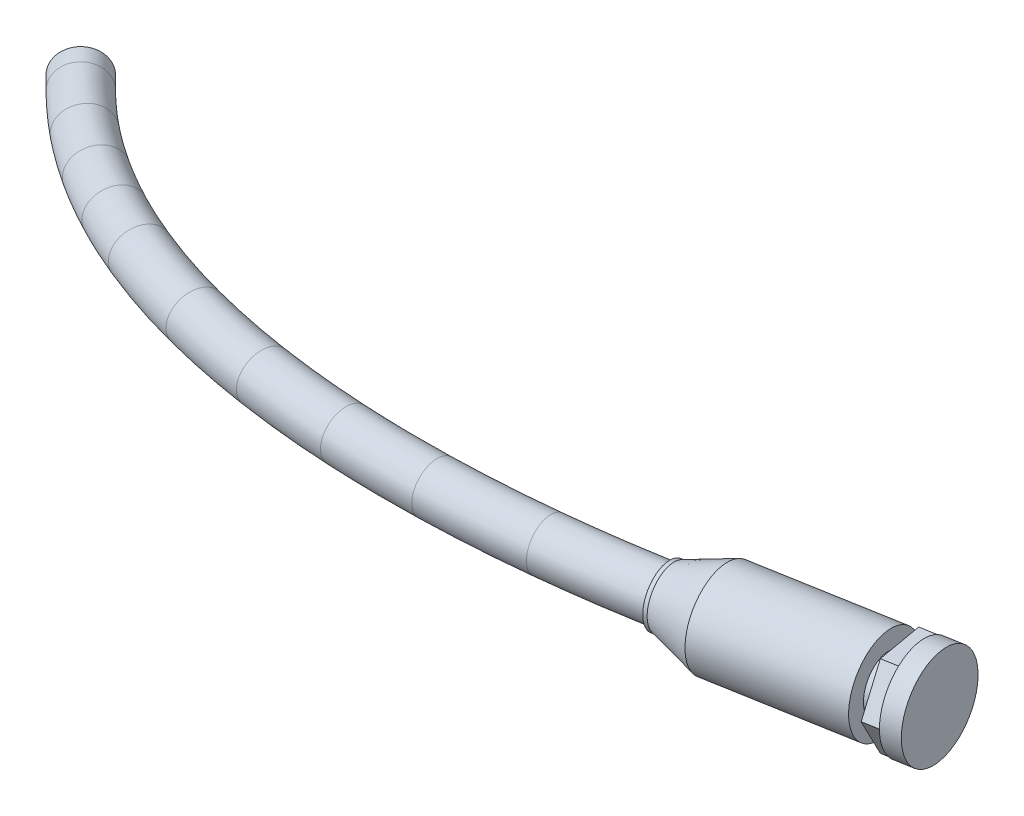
ISO-10303-21;
HEADER;
FILE_DESCRIPTION(('STEP AP214'),'2;1');
FILE_NAME('part.step','',(''),(''),'','','');
FILE_SCHEMA(('AUTOMOTIVE_DESIGN { 1 0 10303 214 1 1 1 1 }'));
ENDSEC;
DATA;
#1=APPLICATION_CONTEXT('core data for automotive mechanical design processes');
#2=APPLICATION_PROTOCOL_DEFINITION('international standard','automotive_design',2000,#1);
#3=PRODUCT_CONTEXT('',#1,'mechanical');
#4=PRODUCT('Part','Part','',(#3));
#5=PRODUCT_RELATED_PRODUCT_CATEGORY('part','',(#4));
#6=PRODUCT_DEFINITION_FORMATION('','',#4);
#7=PRODUCT_DEFINITION_CONTEXT('part definition',#1,'design');
#8=PRODUCT_DEFINITION('design','',#6,#7);
#9=PRODUCT_DEFINITION_SHAPE('','',#8);
#10=(LENGTH_UNIT() NAMED_UNIT(*) SI_UNIT(.MILLI.,.METRE.));
#11=(NAMED_UNIT(*) PLANE_ANGLE_UNIT() SI_UNIT($,.RADIAN.));
#12=(NAMED_UNIT(*) SI_UNIT($,.STERADIAN.) SOLID_ANGLE_UNIT());
#13=UNCERTAINTY_MEASURE_WITH_UNIT(LENGTH_MEASURE(1.E-05),#10,'distance_accuracy_value','');
#14=(GEOMETRIC_REPRESENTATION_CONTEXT(3) GLOBAL_UNCERTAINTY_ASSIGNED_CONTEXT((#13)) GLOBAL_UNIT_ASSIGNED_CONTEXT((#10,
#11,#12)) REPRESENTATION_CONTEXT('',''));
#15=CARTESIAN_POINT('',(0.,0.,0.));
#16=DIRECTION('',(0.,0.,1.));
#17=DIRECTION('',(1.,0.,0.));
#18=AXIS2_PLACEMENT_3D('',#15,#16,#17);
#19=CARTESIAN_POINT('',(-363.716003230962,-33.602255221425,116.094854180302));
#20=DIRECTION('',(-0.984807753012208,0.,0.173648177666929));
#21=DIRECTION('',(0.158351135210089,0.410395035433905,0.898053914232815));
#22=AXIS2_PLACEMENT_3D('',#19,#20,#21);
#23=CYLINDRICAL_SURFACE('',#22,7.1);
#24=CARTESIAN_POINT('',(-382.575071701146,-33.602255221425,119.420216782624));
#25=DIRECTION('',(-0.984807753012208,0.,0.173648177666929));
#26=DIRECTION('',(-0.158351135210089,-0.410395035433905,-0.898053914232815));
#27=AXIS2_PLACEMENT_3D('',#24,#25,#26);
#28=CIRCLE('',#27,7.1);
#29=CARTESIAN_POINT('',(-381.450778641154,-30.6884504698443,125.796399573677));
#30=VERTEX_POINT('',#29);
#31=EDGE_CURVE('E202',#30,#30,#28,.T.);
#32=CARTESIAN_POINT('',(-360.515378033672,-33.602255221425,115.530497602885));
#33=DIRECTION('',(0.984807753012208,0.,-0.173648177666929));
#34=DIRECTION('',(-0.173648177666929,0.,-0.984807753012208));
#35=AXIS2_PLACEMENT_3D('',#32,#33,#34);
#36=CIRCLE('',#35,7.1);
#37=CARTESIAN_POINT('',(-359.39108497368,-30.6884504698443,121.906680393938));
#38=VERTEX_POINT('',#37);
#39=EDGE_CURVE('E21',#38,#38,#36,.F.);
#40=CARTESIAN_POINT('',(-381.450778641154,-30.6884504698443,125.796399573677));
#41=CARTESIAN_POINT('',(-381.220990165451,-30.6884504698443,125.755881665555));
#42=CARTESIAN_POINT('',(-380.991201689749,-30.6884504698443,125.715363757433));
#43=CARTESIAN_POINT('',(-380.531624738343,-30.6884504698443,125.634327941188));
#44=CARTESIAN_POINT('',(-380.30183626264,-30.6884504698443,125.593810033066));
#45=CARTESIAN_POINT('',(-379.842259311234,-30.6884504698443,125.512774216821));
#46=CARTESIAN_POINT('',(-379.612470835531,-30.6884504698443,125.472256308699));
#47=CARTESIAN_POINT('',(-379.152893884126,-30.6884504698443,125.391220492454));
#48=CARTESIAN_POINT('',(-378.923105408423,-30.6884504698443,125.350702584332));
#49=CARTESIAN_POINT('',(-378.463528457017,-30.6884504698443,125.269666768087));
#50=CARTESIAN_POINT('',(-378.233739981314,-30.6884504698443,125.229148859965));
#51=CARTESIAN_POINT('',(-377.774163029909,-30.6884504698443,125.148113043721));
#52=CARTESIAN_POINT('',(-377.544374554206,-30.6884504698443,125.107595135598));
#53=CARTESIAN_POINT('',(-377.0847976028,-30.6884504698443,125.026559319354));
#54=CARTESIAN_POINT('',(-376.855009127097,-30.6884504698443,124.986041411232));
#55=CARTESIAN_POINT('',(-376.395432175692,-30.6884504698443,124.905005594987));
#56=CARTESIAN_POINT('',(-376.165643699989,-30.6884504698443,124.864487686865));
#57=CARTESIAN_POINT('',(-375.706066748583,-30.6884504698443,124.78345187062));
#58=CARTESIAN_POINT('',(-375.47627827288,-30.6884504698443,124.742933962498));
#59=CARTESIAN_POINT('',(-375.016701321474,-30.6884504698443,124.661898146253));
#60=CARTESIAN_POINT('',(-374.786912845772,-30.6884504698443,124.621380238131));
#61=CARTESIAN_POINT('',(-374.327335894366,-30.6884504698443,124.540344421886));
#62=CARTESIAN_POINT('',(-374.097547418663,-30.6884504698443,124.499826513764));
#63=CARTESIAN_POINT('',(-373.637970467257,-30.6884504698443,124.41879069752));
#64=CARTESIAN_POINT('',(-373.408181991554,-30.6884504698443,124.378272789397));
#65=CARTESIAN_POINT('',(-372.948605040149,-30.6884504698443,124.297236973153));
#66=CARTESIAN_POINT('',(-372.718816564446,-30.6884504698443,124.25671906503));
#67=CARTESIAN_POINT('',(-372.25923961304,-30.6884504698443,124.175683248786));
#68=CARTESIAN_POINT('',(-372.029451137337,-30.6884504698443,124.135165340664));
#69=CARTESIAN_POINT('',(-371.569874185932,-30.6884504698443,124.054129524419));
#70=CARTESIAN_POINT('',(-371.340085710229,-30.6884504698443,124.013611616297));
#71=CARTESIAN_POINT('',(-370.880508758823,-30.6884504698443,123.932575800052));
#72=CARTESIAN_POINT('',(-370.65072028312,-30.6884504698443,123.89205789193));
#73=CARTESIAN_POINT('',(-370.191143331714,-30.6884504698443,123.811022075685));
#74=CARTESIAN_POINT('',(-369.961354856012,-30.6884504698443,123.770504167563));
#75=CARTESIAN_POINT('',(-369.501777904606,-30.6884504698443,123.689468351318));
#76=CARTESIAN_POINT('',(-369.271989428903,-30.6884504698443,123.648950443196));
#77=CARTESIAN_POINT('',(-368.812412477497,-30.6884504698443,123.567914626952));
#78=CARTESIAN_POINT('',(-368.582624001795,-30.6884504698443,123.527396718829));
#79=CARTESIAN_POINT('',(-368.123047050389,-30.6884504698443,123.446360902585));
#80=CARTESIAN_POINT('',(-367.893258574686,-30.6884504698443,123.405842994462));
#81=CARTESIAN_POINT('',(-367.43368162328,-30.6884504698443,123.324807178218));
#82=CARTESIAN_POINT('',(-367.203893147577,-30.6884504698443,123.284289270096));
#83=CARTESIAN_POINT('',(-366.744316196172,-30.6884504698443,123.203253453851));
#84=CARTESIAN_POINT('',(-366.514527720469,-30.6884504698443,123.162735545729));
#85=CARTESIAN_POINT('',(-366.054950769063,-30.6884504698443,123.081699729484));
#86=CARTESIAN_POINT('',(-365.82516229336,-30.6884504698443,123.041181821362));
#87=CARTESIAN_POINT('',(-365.365585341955,-30.6884504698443,122.960146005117));
#88=CARTESIAN_POINT('',(-365.135796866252,-30.6884504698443,122.919628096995));
#89=CARTESIAN_POINT('',(-364.676219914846,-30.6884504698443,122.83859228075));
#90=CARTESIAN_POINT('',(-364.446431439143,-30.6884504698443,122.798074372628));
#91=CARTESIAN_POINT('',(-363.986854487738,-30.6884504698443,122.717038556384));
#92=CARTESIAN_POINT('',(-363.757066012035,-30.6884504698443,122.676520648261));
#93=CARTESIAN_POINT('',(-363.297489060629,-30.6884504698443,122.595484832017));
#94=CARTESIAN_POINT('',(-363.067700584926,-30.6884504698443,122.554966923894));
#95=CARTESIAN_POINT('',(-362.60812363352,-30.6884504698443,122.47393110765));
#96=CARTESIAN_POINT('',(-362.378335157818,-30.6884504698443,122.433413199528));
#97=CARTESIAN_POINT('',(-361.918758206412,-30.6884504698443,122.352377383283));
#98=CARTESIAN_POINT('',(-361.688969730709,-30.6884504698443,122.311859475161));
#99=CARTESIAN_POINT('',(-361.229392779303,-30.6884504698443,122.230823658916));
#100=CARTESIAN_POINT('',(-360.9996043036,-30.6884504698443,122.190305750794));
#101=CARTESIAN_POINT('',(-360.540027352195,-30.6884504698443,122.109269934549));
#102=CARTESIAN_POINT('',(-360.310238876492,-30.6884504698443,122.068752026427));
#103=CARTESIAN_POINT('',(-359.850661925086,-30.6884504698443,121.987716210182));
#104=CARTESIAN_POINT('',(-359.620873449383,-30.6884504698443,121.94719830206));
#105=CARTESIAN_POINT('',(-359.39108497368,-30.6884504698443,121.906680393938));
#106=B_SPLINE_CURVE_WITH_KNOTS('',3,(#40,#41,#42,#43,#44,#45,#46,#47,#48,#49,#50,#51,#52,#53,
#54,#55,#56,#57,#58,#59,#60,#61,#62,#63,#64,#65,#66,#67,#68,#69,#70,#71,#72,#73,#74,#75,#76,#77,
#78,#79,#80,#81,#82,#83,#84,#85,#86,#87,#88,#89,#90,#91,#92,#93,#94,#95,#96,#97,#98,#99,#100,
#101,#102,#103,#104,#105),.UNSPECIFIED.,.F.,.F.,(4,2,2,2,2,2,2,2,2,2,2,2,2,2,2,2,2,2,2,2,2,2,2,
2,2,2,2,2,2,2,2,2,4),(0.,0.699999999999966,1.39999999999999,2.10000000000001,2.80000000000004,
3.50000000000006,4.20000000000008,4.90000000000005,5.60000000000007,6.30000000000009,
7.00000000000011,7.70000000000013,8.40000000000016,9.10000000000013,9.80000000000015,
10.5000000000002,11.2000000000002,11.9000000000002,12.6000000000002,13.3000000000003,
14.0000000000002,14.7000000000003,15.4000000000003,16.1000000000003,16.8000000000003,
17.5000000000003,18.2000000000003,18.9000000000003,19.6000000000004,20.3000000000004,
21.0000000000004,21.7000000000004,22.4000000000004),.UNSPECIFIED.);
#107=EDGE_CURVE('BSEAM17',#30,#38,#106,.T.);
#108=ORIENTED_EDGE('',*,*,#31,.F.);
#109=ORIENTED_EDGE('',*,*,#39,.T.);
#110=ORIENTED_EDGE('',*,*,#107,.T.);
#111=ORIENTED_EDGE('',*,*,#107,.F.);
#112=EDGE_LOOP('',(#108,#110,#109,#111));
#113=FACE_BOUND('',#112,.T.);
#114=ADVANCED_FACE('F17',(#113),#23,.T.);
#115=CARTESIAN_POINT('',(-504.622129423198,-30.2644895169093,98.9526170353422));
#116=DIRECTION('',(-0.707106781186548,0.,-0.707106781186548));
#117=DIRECTION('',(0.0192656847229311,0.999628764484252,-0.019265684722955));
#118=AXIS2_PLACEMENT_3D('',#115,#116,#117);
#119=PLANE('',#118);
#120=CARTESIAN_POINT('',(-504.622129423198,-30.2644895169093,98.9526170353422));
#121=DIRECTION('',(-0.707106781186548,0.,-0.707106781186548));
#122=DIRECTION('',(0.0192656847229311,0.999628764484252,-0.019265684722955));
#123=AXIS2_PLACEMENT_3D('',#120,#121,#122);
#124=CIRCLE('',#123,3.9);
#125=CARTESIAN_POINT('',(-504.546993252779,-26.3659373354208,98.8774808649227));
#126=VERTEX_POINT('',#125);
#127=EDGE_CURVE('E272',#126,#126,#124,.T.);
#128=ORIENTED_EDGE('',*,*,#127,.T.);
#129=EDGE_LOOP('',(#128));
#130=FACE_BOUND('',#129,.T.);
#131=ADVANCED_FACE('F345',(#130),#119,.T.);
#132=CARTESIAN_POINT('',(-502.536164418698,-30.2644895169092,101.038582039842));
#133=DIRECTION('',(-0.707106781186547,0.,-0.707106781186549));
#134=DIRECTION('',(-0.707106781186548,0.,0.707106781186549));
#135=AXIS2_PLACEMENT_3D('',#132,#133,#134);
#136=CYLINDRICAL_SURFACE('',#135,3.9);
#137=CARTESIAN_POINT('',(-502.536164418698,-30.2644895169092,101.038582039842));
#138=DIRECTION('',(-0.707106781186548,0.,-0.707106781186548));
#139=DIRECTION('',(0.0192656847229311,0.999628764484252,-0.019265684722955));
#140=AXIS2_PLACEMENT_3D('',#137,#138,#139);
#141=CIRCLE('',#140,3.9);
#142=CARTESIAN_POINT('',(-505.279085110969,-29.8610392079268,103.781502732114));
#143=VERTEX_POINT('',#142);
#144=EDGE_CURVE('E276',#143,#143,#141,.T.);
#145=ORIENTED_EDGE('',*,*,#144,.T.);
#146=EDGE_LOOP('',(#145));
#147=FACE_BOUND('',#146,.T.);
#148=ORIENTED_EDGE('',*,*,#127,.F.);
#149=EDGE_LOOP('',(#148));
#150=FACE_BOUND('',#149,.T.);
#151=ADVANCED_FACE('F880',(#147,#150),#136,.T.);
#152=CARTESIAN_POINT('',(-451.406436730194,-37.7850512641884,49.9088543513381));
#153=DIRECTION('',(-0.073149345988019,-0.994634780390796,0.0731493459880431));
#154=DIRECTION('',(-0.98125293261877,0.0848898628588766,0.173021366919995));
#155=AXIS2_PLACEMENT_3D('',#152,#153,#154);
#156=TOROIDAL_SURFACE('',#155,72.6983972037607,3.9);
#157=CARTESIAN_POINT('',(-496.585840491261,-30.3099152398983,106.371238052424));
#158=DIRECTION('',(-0.780020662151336,0.0113529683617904,-0.625650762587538));
#159=DIRECTION('',(0.0255116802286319,0.999581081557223,-0.0136680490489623));
#160=AXIS2_PLACEMENT_3D('',#157,#158,#159);
#161=CIRCLE('',#160,3.9);
#162=CARTESIAN_POINT('',(-499.009548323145,-29.9089018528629,109.400236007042));
#163=VERTEX_POINT('',#162);
#164=EDGE_CURVE('E280',#163,#163,#161,.T.);
#165=CARTESIAN_POINT('',(-451.406436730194,-37.7850512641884,49.9088543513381));
#166=DIRECTION('',(-0.073149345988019,-0.994634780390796,0.0731493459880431));
#167=DIRECTION('',(-0.98125293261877,0.0848898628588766,0.173021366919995));
#168=AXIS2_PLACEMENT_3D('',#165,#166,#167);
#169=CIRCLE('',#168,76.5983972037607);
#170=EDGE_CURVE('',#163,#143,#169,.T.);
#171=ORIENTED_EDGE('',*,*,#164,.T.);
#172=ORIENTED_EDGE('',*,*,#144,.F.);
#173=ORIENTED_EDGE('',*,*,#170,.T.);
#174=ORIENTED_EDGE('',*,*,#170,.F.);
#175=EDGE_LOOP('',(#171,#173,#172,#174));
#176=FACE_BOUND('',#175,.T.);
#177=ADVANCED_FACE('F867',(#176),#156,.T.);
#178=CARTESIAN_POINT('',(-451.02469776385,-36.973098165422,49.4476606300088));
#179=DIRECTION('',(-0.0657658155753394,-0.995785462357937,0.0639231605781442));
#180=DIRECTION('',(-0.98196192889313,0.0759677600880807,0.173146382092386));
#181=AXIS2_PLACEMENT_3D('',#178,#179,#180);
#182=TOROIDAL_SURFACE('',#181,73.2154997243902,3.9);
#183=CARTESIAN_POINT('',(-490.091022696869,-30.4401783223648,111.024057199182));
#184=DIRECTION('',(-0.843188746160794,0.0212028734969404,-0.537199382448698));
#185=DIRECTION('',(0.0312304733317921,0.99946638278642,-0.00957116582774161));
#186=AXIS2_PLACEMENT_3D('',#183,#184,#185);
#187=CIRCLE('',#186,3.9);
#188=CARTESIAN_POINT('',(-492.17369868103,-30.1188926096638,114.305708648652));
#189=VERTEX_POINT('',#188);
#190=EDGE_CURVE('E284',#189,#189,#187,.T.);
#191=ORIENTED_EDGE('',*,*,#190,.T.);
#192=EDGE_LOOP('',(#191));
#193=FACE_BOUND('',#192,.T.);
#194=ORIENTED_EDGE('',*,*,#164,.F.);
#195=EDGE_LOOP('',(#194));
#196=FACE_BOUND('',#195,.T.);
#197=ADVANCED_FACE('F854',(#193,#196),#182,.T.);
#198=CARTESIAN_POINT('',(-449.838395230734,-36.6497827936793,47.5983998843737));
#199=DIRECTION('',(-0.0620961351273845,-0.996375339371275,0.0581399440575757));
#200=DIRECTION('',(-0.982299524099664,0.0713257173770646,0.173205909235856));
#201=AXIS2_PLACEMENT_3D('',#198,#199,#200);
#202=TOROIDAL_SURFACE('',#201,75.3767020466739,3.9);
#203=CARTESIAN_POINT('',(-483.27639110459,-30.6396148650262,114.884546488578));
#204=DIRECTION('',(-0.894065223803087,0.0296394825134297,-0.446955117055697));
#205=DIRECTION('',(0.0364384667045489,0.999313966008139,-0.00662083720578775));
#206=AXIS2_PLACEMENT_3D('',#203,#204,#205);
#207=CIRCLE('',#206,3.9);
#208=CARTESIAN_POINT('',(-485.006477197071,-30.328648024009,118.365940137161));
#209=VERTEX_POINT('',#208);
#210=EDGE_CURVE('E288',#209,#209,#207,.T.);
#211=CARTESIAN_POINT('',(-449.838395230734,-36.6497827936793,47.5983998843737));
#212=DIRECTION('',(-0.0620961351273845,-0.996375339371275,0.0581399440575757));
#213=DIRECTION('',(-0.982299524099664,0.0713257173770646,0.173205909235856));
#214=AXIS2_PLACEMENT_3D('',#211,#212,#213);
#215=CIRCLE('',#214,79.2767020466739);
#216=EDGE_CURVE('',#209,#189,#215,.T.);
#217=ORIENTED_EDGE('',*,*,#210,.T.);
#218=ORIENTED_EDGE('',*,*,#190,.F.);
#219=ORIENTED_EDGE('',*,*,#216,.T.);
#220=ORIENTED_EDGE('',*,*,#216,.F.);
#221=EDGE_LOOP('',(#217,#219,#218,#220));
#222=FACE_BOUND('',#221,.T.);
#223=ADVANCED_FACE('F841',(#222),#202,.T.);
#224=CARTESIAN_POINT('',(-446.379813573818,-35.9818252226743,40.7243323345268));
#225=DIRECTION('',(-0.0552480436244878,-0.997486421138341,0.0443677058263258));
#226=DIRECTION('',(-0.982903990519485,0.0621492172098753,0.173312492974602));
#227=AXIS2_PLACEMENT_3D('',#224,#225,#226);
#228=TOROIDAL_SURFACE('',#227,83.0038192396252,3.9);
#229=CARTESIAN_POINT('',(-476.113378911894,-30.895436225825,118.05270841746));
#230=DIRECTION('',(-0.932001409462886,0.0355770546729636,-0.360704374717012));
#231=DIRECTION('',(0.0400805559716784,0.999183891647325,-0.00500996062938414));
#232=AXIS2_PLACEMENT_3D('',#229,#230,#231);
#233=CIRCLE('',#232,3.9);
#234=CARTESIAN_POINT('',(-477.513020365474,-30.705137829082,121.687923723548));
#235=VERTEX_POINT('',#234);
#236=EDGE_CURVE('E292',#235,#235,#233,.T.);
#237=ORIENTED_EDGE('',*,*,#236,.T.);
#238=EDGE_LOOP('',(#237));
#239=FACE_BOUND('',#238,.T.);
#240=ORIENTED_EDGE('',*,*,#210,.F.);
#241=EDGE_LOOP('',(#240));
#242=FACE_BOUND('',#241,.T.);
#243=ADVANCED_FACE('F828',(#239,#242),#228,.T.);
#244=CARTESIAN_POINT('',(-443.431482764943,-35.3389402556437,33.1697344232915));
#245=DIRECTION('',(-0.0507619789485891,-0.998175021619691,0.0327085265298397));
#246=DIRECTION('',(-0.983279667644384,0.0556858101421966,0.173378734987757));
#247=AXIS2_PLACEMENT_3D('',#244,#245,#246);
#248=TOROIDAL_SURFACE('',#247,91.0657473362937,3.9);
#249=CARTESIAN_POINT('',(-463.478255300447,-31.4114411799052,121.914717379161));
#250=DIRECTION('',(-0.974147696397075,0.0422680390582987,-0.221922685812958));
#251=DIRECTION('',(0.0442014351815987,0.999015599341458,-0.00375038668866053));
#252=AXIS2_PLACEMENT_3D('',#249,#250,#251);
#253=CIRCLE('',#252,3.9);
#254=CARTESIAN_POINT('',(-464.336782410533,-31.2432413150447,125.715327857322));
#255=VERTEX_POINT('',#254);
#256=EDGE_CURVE('E296',#255,#255,#253,.T.);
#257=CARTESIAN_POINT('',(-443.431482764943,-35.3389402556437,33.1697344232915));
#258=DIRECTION('',(-0.0507619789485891,-0.998175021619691,0.0327085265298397));
#259=DIRECTION('',(-0.983279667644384,0.0556858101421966,0.173378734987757));
#260=AXIS2_PLACEMENT_3D('',#257,#258,#259);
#261=CIRCLE('',#260,94.9657473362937);
#262=EDGE_CURVE('',#255,#235,#261,.T.);
#263=ORIENTED_EDGE('',*,*,#256,.T.);
#264=ORIENTED_EDGE('',*,*,#236,.F.);
#265=ORIENTED_EDGE('',*,*,#262,.T.);
#266=ORIENTED_EDGE('',*,*,#262,.F.);
#267=EDGE_LOOP('',(#263,#265,#264,#266));
#268=FACE_BOUND('',#267,.T.);
#269=ADVANCED_FACE('F815',(#268),#248,.T.);
#270=CARTESIAN_POINT('',(-436.845440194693,-31.8042552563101,4.93299075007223));
#271=DIRECTION('',(-0.0419398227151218,-0.999100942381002,-0.00619340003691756));
#272=DIRECTION('',(-0.984010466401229,0.0402307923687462,0.173507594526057));
#273=AXIS2_PLACEMENT_3D('',#270,#271,#272);
#274=TOROIDAL_SURFACE('',#273,119.975770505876,3.9);
#275=CARTESIAN_POINT('',(-450.440962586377,-31.9724836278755,124.135838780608));
#276=DIRECTION('',(-0.992673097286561,0.042371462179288,-0.113158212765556));
#277=DIRECTION('',(0.0430932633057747,0.999063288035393,-0.0039391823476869));
#278=AXIS2_PLACEMENT_3D('',#275,#276,#277);
#279=CIRCLE('',#278,3.9);
#280=CARTESIAN_POINT('',(-450.887187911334,-32.0838357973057,128.008626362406));
#281=VERTEX_POINT('',#280);
#282=EDGE_CURVE('E300',#281,#281,#279,.T.);
#283=ORIENTED_EDGE('',*,*,#282,.T.);
#284=EDGE_LOOP('',(#283));
#285=FACE_BOUND('',#284,.T.);
#286=ORIENTED_EDGE('',*,*,#256,.F.);
#287=EDGE_LOOP('',(#286));
#288=FACE_BOUND('',#287,.T.);
#289=ADVANCED_FACE('F802',(#285,#288),#274,.T.);
#290=CARTESIAN_POINT('',(-434.36979547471,-27.9620449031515,-15.3457480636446));
#291=DIRECTION('',(-0.038844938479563,-0.998693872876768,-0.0331906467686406));
#292=DIRECTION('',(-0.173512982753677,0.0394525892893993,-0.984041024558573));
#293=AXIS2_PLACEMENT_3D('',#290,#291,#292);
#294=TOROIDAL_SURFACE('',#293,140.46166416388,3.9);
#295=CARTESIAN_POINT('',(-436.577679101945,-32.5412198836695,125.023890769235));
#296=DIRECTION('',(-0.999121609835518,0.0393412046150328,-0.0144318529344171));
#297=DIRECTION('',(0.0394051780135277,0.999214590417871,-0.00417543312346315));
#298=AXIS2_PLACEMENT_3D('',#295,#296,#297);
#299=CIRCLE('',#298,3.9);
#300=CARTESIAN_POINT('',(-436.638982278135,-32.6683633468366,128.921335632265));
#301=VERTEX_POINT('',#300);
#302=EDGE_CURVE('E304',#301,#301,#299,.T.);
#303=CARTESIAN_POINT('',(-434.36979547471,-27.9620449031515,-15.3457480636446));
#304=DIRECTION('',(-0.038844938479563,-0.998693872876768,-0.0331906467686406));
#305=DIRECTION('',(-0.173512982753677,0.0394525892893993,-0.984041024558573));
#306=AXIS2_PLACEMENT_3D('',#303,#304,#305);
#307=CIRCLE('',#306,144.36166416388);
#308=EDGE_CURVE('',#301,#281,#307,.T.);
#309=ORIENTED_EDGE('',*,*,#302,.T.);
#310=ORIENTED_EDGE('',*,*,#282,.F.);
#311=ORIENTED_EDGE('',*,*,#308,.T.);
#312=ORIENTED_EDGE('',*,*,#308,.F.);
#313=EDGE_LOOP('',(#309,#311,#310,#312));
#314=FACE_BOUND('',#313,.T.);
#315=ADVANCED_FACE('F789',(#314),#294,.T.);
#316=CARTESIAN_POINT('',(-432.954505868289,-11.1523069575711,-67.5033672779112));
#317=DIRECTION('',(-0.0375005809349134,-0.993108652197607,-0.111035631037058));
#318=DIRECTION('',(-0.172478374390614,0.115878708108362,-0.978173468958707));
#319=AXIS2_PLACEMENT_3D('',#316,#317,#318);
#320=TOROIDAL_SURFACE('',#319,193.745601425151,3.9);
#321=CARTESIAN_POINT('',(-422.678099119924,-33.0330227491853,124.728232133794));
#322=DIRECTION('',(-0.997887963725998,0.0313181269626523,0.0569103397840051));
#323=DIRECTION('',(0.0311408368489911,0.999507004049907,-0.00399964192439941));
#324=AXIS2_PLACEMENT_3D('',#321,#322,#323);
#325=CIRCLE('',#324,3.9);
#326=CARTESIAN_POINT('',(-422.480288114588,-33.7026390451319,128.56522116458));
#327=VERTEX_POINT('',#326);
#328=EDGE_CURVE('E308',#327,#327,#325,.T.);
#329=ORIENTED_EDGE('',*,*,#328,.T.);
#330=EDGE_LOOP('',(#329));
#331=FACE_BOUND('',#330,.T.);
#332=ORIENTED_EDGE('',*,*,#302,.F.);
#333=EDGE_LOOP('',(#332));
#334=FACE_BOUND('',#333,.T.);
#335=ADVANCED_FACE('F776',(#331,#334),#320,.T.);
#336=CARTESIAN_POINT('',(-434.318259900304,6.37045398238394,-101.058847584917));
#337=DIRECTION('',(-0.0405834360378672,-0.984651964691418,-0.169745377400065));
#338=DIRECTION('',(-0.170992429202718,0.174223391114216,-0.969746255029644));
#339=AXIS2_PLACEMENT_3D('',#336,#337,#338);
#340=TOROIDAL_SURFACE('',#339,229.494951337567,3.9);
#341=CARTESIAN_POINT('',(-406.315066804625,-33.4464244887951,123.214133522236));
#342=DIRECTION('',(-0.991697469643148,0.0189475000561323,0.127189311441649));
#343=DIRECTION('',(0.0187369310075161,0.999820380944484,-0.00285188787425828));
#344=AXIS2_PLACEMENT_3D('',#341,#342,#343);
#345=CIRCLE('',#344,3.9);
#346=CARTESIAN_POINT('',(-405.839185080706,-34.1230660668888,127.025392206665));
#347=VERTEX_POINT('',#346);
#348=EDGE_CURVE('E312',#347,#347,#345,.T.);
#349=CARTESIAN_POINT('',(-434.318259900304,6.37045398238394,-101.058847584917));
#350=DIRECTION('',(-0.0405834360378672,-0.984651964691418,-0.169745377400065));
#351=DIRECTION('',(-0.170992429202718,0.174223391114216,-0.969746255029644));
#352=AXIS2_PLACEMENT_3D('',#349,#350,#351);
#353=CIRCLE('',#352,233.394951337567);
#354=EDGE_CURVE('',#347,#327,#353,.T.);
#355=ORIENTED_EDGE('',*,*,#348,.T.);
#356=ORIENTED_EDGE('',*,*,#328,.F.);
#357=ORIENTED_EDGE('',*,*,#354,.T.);
#358=ORIENTED_EDGE('',*,*,#354,.F.);
#359=EDGE_LOOP('',(#355,#357,#356,#358));
#360=FACE_BOUND('',#359,.T.);
#361=ADVANCED_FACE('F764',(#360),#340,.T.);
#362=CARTESIAN_POINT('',(-442.342672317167,87.907822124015,-175.772034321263));
#363=DIRECTION('',(-0.0649869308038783,-0.927329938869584,-0.368559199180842));
#364=DIRECTION('',(-0.16102915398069,0.374244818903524,-0.913241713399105));
#365=AXIS2_PLACEMENT_3D('',#362,#363,#364);
#366=TOROIDAL_SURFACE('',#365,324.680720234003,3.9);
#367=CARTESIAN_POINT('',(-390.059610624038,-33.6022552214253,120.739942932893));
#368=DIRECTION('',(-0.984807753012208,0.,0.17364817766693));
#369=DIRECTION('',(0.,1.,0.));
#370=AXIS2_PLACEMENT_3D('',#367,#368,#369);
#371=CIRCLE('',#370,3.9);
#372=CARTESIAN_POINT('',(-390.059610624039,-29.7022552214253,120.739942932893));
#373=VERTEX_POINT('',#372);
#374=EDGE_CURVE('E265',#373,#373,#371,.T.);
#375=ORIENTED_EDGE('',*,*,#374,.T.);
#376=EDGE_LOOP('',(#375));
#377=FACE_BOUND('',#376,.T.);
#378=ORIENTED_EDGE('',*,*,#348,.F.);
#379=EDGE_LOOP('',(#378));
#380=FACE_BOUND('',#379,.T.);
#381=ADVANCED_FACE('F321',(#377,#380),#366,.T.);
#382=CARTESIAN_POINT('',(-390.415900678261,-34.5256440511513,118.719321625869));
#383=DIRECTION('',(-0.984807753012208,0.,0.173648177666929));
#384=DIRECTION('',(0.0712643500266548,-0.911907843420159,0.404160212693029));
#385=AXIS2_PLACEMENT_3D('',#382,#383,#384);
#386=PLANE('',#385);
#387=ORIENTED_EDGE('',*,*,#374,.F.);
#388=EDGE_LOOP('',(#387));
#389=FACE_BOUND('',#388,.T.);
#390=CARTESIAN_POINT('',(-390.059610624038,-33.6022552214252,120.739942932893));
#391=DIRECTION('',(-0.984807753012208,0.,0.173648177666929));
#392=DIRECTION('',(-0.158351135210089,-0.410395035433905,-0.898053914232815));
#393=AXIS2_PLACEMENT_3D('',#390,#391,#392);
#394=CIRCLE('',#393,4.5);
#395=CARTESIAN_POINT('',(-389.347030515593,-31.7554775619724,124.781185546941));
#396=VERTEX_POINT('',#395);
#397=EDGE_CURVE('E261',#396,#396,#394,.T.);
#398=ORIENTED_EDGE('',*,*,#397,.T.);
#399=EDGE_LOOP('',(#398));
#400=FACE_BOUND('',#399,.T.);
#401=ADVANCED_FACE('F324',(#389,#400),#386,.T.);
#402=CARTESIAN_POINT('',(-389.764168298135,-33.602255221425,120.687848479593));
#403=DIRECTION('',(-0.984807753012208,0.,0.173648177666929));
#404=DIRECTION('',(0.158351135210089,0.410395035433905,0.898053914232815));
#405=AXIS2_PLACEMENT_3D('',#402,#403,#404);
#406=CYLINDRICAL_SURFACE('',#405,4.5);
#407=CARTESIAN_POINT('',(-389.468725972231,-33.6022552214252,120.635754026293));
#408=DIRECTION('',(-0.984807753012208,0.,0.173648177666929));
#409=DIRECTION('',(-0.158351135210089,-0.410395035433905,-0.898053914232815));
#410=AXIS2_PLACEMENT_3D('',#407,#408,#409);
#411=CIRCLE('',#410,4.5);
#412=CARTESIAN_POINT('',(-388.756145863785,-31.7554775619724,124.67699664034));
#413=VERTEX_POINT('',#412);
#414=EDGE_CURVE('E209',#413,#413,#411,.T.);
#415=CARTESIAN_POINT('',(-389.347030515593,-31.7554775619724,124.781185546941));
#416=CARTESIAN_POINT('',(-389.340875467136,-31.7554775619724,124.78010024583));
#417=CARTESIAN_POINT('',(-389.33472041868,-31.7554775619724,124.77901494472));
#418=CARTESIAN_POINT('',(-389.322410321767,-31.7554775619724,124.776844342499));
#419=CARTESIAN_POINT('',(-389.316255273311,-31.7554775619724,124.775759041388));
#420=CARTESIAN_POINT('',(-389.303945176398,-31.7554775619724,124.773588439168));
#421=CARTESIAN_POINT('',(-389.297790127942,-31.7554775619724,124.772503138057));
#422=CARTESIAN_POINT('',(-389.285480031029,-31.7554775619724,124.770332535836));
#423=CARTESIAN_POINT('',(-389.279324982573,-31.7554775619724,124.769247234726));
#424=CARTESIAN_POINT('',(-389.26701488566,-31.7554775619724,124.767076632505));
#425=CARTESIAN_POINT('',(-389.260859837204,-31.7554775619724,124.765991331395));
#426=CARTESIAN_POINT('',(-389.248549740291,-31.7554775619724,124.763820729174));
#427=CARTESIAN_POINT('',(-389.242394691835,-31.7554775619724,124.762735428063));
#428=CARTESIAN_POINT('',(-389.230084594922,-31.7554775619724,124.760564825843));
#429=CARTESIAN_POINT('',(-389.223929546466,-31.7554775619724,124.759479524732));
#430=CARTESIAN_POINT('',(-389.211619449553,-31.7554775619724,124.757308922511));
#431=CARTESIAN_POINT('',(-389.205464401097,-31.7554775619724,124.756223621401));
#432=CARTESIAN_POINT('',(-389.193154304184,-31.7554775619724,124.75405301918));
#433=CARTESIAN_POINT('',(-389.186999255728,-31.7554775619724,124.75296771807));
#434=CARTESIAN_POINT('',(-389.174689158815,-31.7554775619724,124.750797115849));
#435=CARTESIAN_POINT('',(-389.168534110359,-31.7554775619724,124.749711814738));
#436=CARTESIAN_POINT('',(-389.156224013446,-31.7554775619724,124.747541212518));
#437=CARTESIAN_POINT('',(-389.15006896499,-31.7554775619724,124.746455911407));
#438=CARTESIAN_POINT('',(-389.137758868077,-31.7554775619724,124.744285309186));
#439=CARTESIAN_POINT('',(-389.131603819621,-31.7554775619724,124.743200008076));
#440=CARTESIAN_POINT('',(-389.119293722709,-31.7554775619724,124.741029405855));
#441=CARTESIAN_POINT('',(-389.113138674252,-31.7554775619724,124.739944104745));
#442=CARTESIAN_POINT('',(-389.100828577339,-31.7554775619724,124.737773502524));
#443=CARTESIAN_POINT('',(-389.094673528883,-31.7554775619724,124.736688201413));
#444=CARTESIAN_POINT('',(-389.082363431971,-31.7554775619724,124.734517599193));
#445=CARTESIAN_POINT('',(-389.076208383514,-31.7554775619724,124.733432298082));
#446=CARTESIAN_POINT('',(-389.063898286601,-31.7554775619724,124.731261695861));
#447=CARTESIAN_POINT('',(-389.057743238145,-31.7554775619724,124.730176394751));
#448=CARTESIAN_POINT('',(-389.045433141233,-31.7554775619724,124.72800579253));
#449=CARTESIAN_POINT('',(-389.039278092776,-31.7554775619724,124.72692049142));
#450=CARTESIAN_POINT('',(-389.026967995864,-31.7554775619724,124.724749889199));
#451=CARTESIAN_POINT('',(-389.020812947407,-31.7554775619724,124.723664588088));
#452=CARTESIAN_POINT('',(-389.008502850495,-31.7554775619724,124.721493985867));
#453=CARTESIAN_POINT('',(-389.002347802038,-31.7554775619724,124.720408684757));
#454=CARTESIAN_POINT('',(-388.990037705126,-31.7554775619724,124.718238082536));
#455=CARTESIAN_POINT('',(-388.983882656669,-31.7554775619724,124.717152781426));
#456=CARTESIAN_POINT('',(-388.971572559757,-31.7554775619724,124.714982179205));
#457=CARTESIAN_POINT('',(-388.9654175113,-31.7554775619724,124.713896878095));
#458=CARTESIAN_POINT('',(-388.953107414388,-31.7554775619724,124.711726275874));
#459=CARTESIAN_POINT('',(-388.946952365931,-31.7554775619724,124.710640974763));
#460=CARTESIAN_POINT('',(-388.934642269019,-31.7554775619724,124.708470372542));
#461=CARTESIAN_POINT('',(-388.928487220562,-31.7554775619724,124.707385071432));
#462=CARTESIAN_POINT('',(-388.91617712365,-31.7554775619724,124.705214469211));
#463=CARTESIAN_POINT('',(-388.910022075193,-31.7554775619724,124.704129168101));
#464=CARTESIAN_POINT('',(-388.897711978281,-31.7554775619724,124.70195856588));
#465=CARTESIAN_POINT('',(-388.891556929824,-31.7554775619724,124.70087326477));
#466=CARTESIAN_POINT('',(-388.879246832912,-31.7554775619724,124.698702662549));
#467=CARTESIAN_POINT('',(-388.873091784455,-31.7554775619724,124.697617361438));
#468=CARTESIAN_POINT('',(-388.860781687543,-31.7554775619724,124.695446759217));
#469=CARTESIAN_POINT('',(-388.854626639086,-31.7554775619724,124.694361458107));
#470=CARTESIAN_POINT('',(-388.842316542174,-31.7554775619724,124.692190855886));
#471=CARTESIAN_POINT('',(-388.836161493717,-31.7554775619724,124.691105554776));
#472=CARTESIAN_POINT('',(-388.823851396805,-31.7554775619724,124.688934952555));
#473=CARTESIAN_POINT('',(-388.817696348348,-31.7554775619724,124.687849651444));
#474=CARTESIAN_POINT('',(-388.805386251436,-31.7554775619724,124.685679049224));
#475=CARTESIAN_POINT('',(-388.799231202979,-31.7554775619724,124.684593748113));
#476=CARTESIAN_POINT('',(-388.786921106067,-31.7554775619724,124.682423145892));
#477=CARTESIAN_POINT('',(-388.78076605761,-31.7554775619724,124.681337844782));
#478=CARTESIAN_POINT('',(-388.768455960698,-31.7554775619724,124.679167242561));
#479=CARTESIAN_POINT('',(-388.762300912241,-31.7554775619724,124.678081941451));
#480=CARTESIAN_POINT('',(-388.756145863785,-31.7554775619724,124.67699664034));
#481=B_SPLINE_CURVE_WITH_KNOTS('',3,(#415,#416,#417,#418,#419,#420,#421,#422,#423,#424,#425,
#426,#427,#428,#429,#430,#431,#432,#433,#434,#435,#436,#437,#438,#439,#440,#441,#442,#443,#444,
#445,#446,#447,#448,#449,#450,#451,#452,#453,#454,#455,#456,#457,#458,#459,#460,#461,#462,#463,
#464,#465,#466,#467,#468,#469,#470,#471,#472,#473,#474,#475,#476,#477,#478,#479,#480),
.UNSPECIFIED.,.F.,.F.,(4,2,2,2,2,2,2,2,2,2,2,2,2,2,2,2,2,2,2,2,2,2,2,2,2,2,2,2,2,2,2,2,4),(0.,
0.0187499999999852,0.037499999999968,0.0562500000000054,0.0749999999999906,0.0937499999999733,
0.112500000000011,0.131249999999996,0.150000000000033,0.168750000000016,0.187500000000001,
0.206250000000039,0.225000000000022,0.243750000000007,0.262500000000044,0.281250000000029,
0.300000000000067,0.31875000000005,0.337500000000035,0.356250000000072,0.375000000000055,
0.39375000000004,0.412500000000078,0.43125000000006,0.4500000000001,0.468750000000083,
0.487500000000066,0.506250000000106,0.525000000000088,0.543750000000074,0.562500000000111,
0.581250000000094,0.600000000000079),.UNSPECIFIED.);
#482=EDGE_CURVE('BSEAM327',#396,#413,#481,.T.);
#483=ORIENTED_EDGE('',*,*,#397,.F.);
#484=ORIENTED_EDGE('',*,*,#414,.T.);
#485=ORIENTED_EDGE('',*,*,#482,.T.);
#486=ORIENTED_EDGE('',*,*,#482,.F.);
#487=EDGE_LOOP('',(#483,#485,#484,#486));
#488=FACE_BOUND('',#487,.T.);
#489=ADVANCED_FACE('F327',(#488),#406,.T.);
#490=CARTESIAN_POINT('',(-386.021898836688,-33.602255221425,120.027985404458));
#491=DIRECTION('',(0.984807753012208,0.,-0.173648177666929));
#492=DIRECTION('',(0.158351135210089,0.410395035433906,0.898053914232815));
#493=AXIS2_PLACEMENT_3D('',#490,#491,#492);
#494=CONICAL_SURFACE('',#493,5.8,0.35563588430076);
#495=CARTESIAN_POINT('',(-388.756145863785,-31.7554775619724,124.67699664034));
#496=CARTESIAN_POINT('',(-388.680048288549,-31.7443626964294,124.688657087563));
#497=CARTESIAN_POINT('',(-388.603950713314,-31.7332478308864,124.700317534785));
#498=CARTESIAN_POINT('',(-388.451755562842,-31.7110180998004,124.723638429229));
#499=CARTESIAN_POINT('',(-388.375657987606,-31.6999032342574,124.735298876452));
#500=CARTESIAN_POINT('',(-388.223462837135,-31.6776735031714,124.758619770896));
#501=CARTESIAN_POINT('',(-388.147365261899,-31.6665586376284,124.770280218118));
#502=CARTESIAN_POINT('',(-387.995170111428,-31.6443289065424,124.793601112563));
#503=CARTESIAN_POINT('',(-387.919072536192,-31.6332140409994,124.805261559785));
#504=CARTESIAN_POINT('',(-387.766877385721,-31.6109843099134,124.82858245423));
#505=CARTESIAN_POINT('',(-387.690779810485,-31.5998694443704,124.840242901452));
#506=CARTESIAN_POINT('',(-387.538584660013,-31.5776397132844,124.863563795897));
#507=CARTESIAN_POINT('',(-387.462487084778,-31.5665248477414,124.875224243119));
#508=CARTESIAN_POINT('',(-387.310291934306,-31.5442951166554,124.898545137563));
#509=CARTESIAN_POINT('',(-387.23419435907,-31.5331802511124,124.910205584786));
#510=CARTESIAN_POINT('',(-387.081999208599,-31.5109505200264,124.93352647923));
#511=CARTESIAN_POINT('',(-387.005901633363,-31.4998356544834,124.945186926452));
#512=CARTESIAN_POINT('',(-386.853706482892,-31.4776059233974,124.968507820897));
#513=CARTESIAN_POINT('',(-386.777608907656,-31.4664910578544,124.980168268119));
#514=CARTESIAN_POINT('',(-386.625413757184,-31.4442613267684,125.003489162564));
#515=CARTESIAN_POINT('',(-386.549316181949,-31.4331464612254,125.015149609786));
#516=CARTESIAN_POINT('',(-386.397121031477,-31.4109167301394,125.03847050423));
#517=CARTESIAN_POINT('',(-386.321023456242,-31.3998018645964,125.050130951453));
#518=CARTESIAN_POINT('',(-386.16882830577,-31.3775721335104,125.073451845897));
#519=CARTESIAN_POINT('',(-386.092730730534,-31.3664572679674,125.085112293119));
#520=CARTESIAN_POINT('',(-385.940535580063,-31.3442275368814,125.108433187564));
#521=CARTESIAN_POINT('',(-385.864438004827,-31.3331126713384,125.120093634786));
#522=CARTESIAN_POINT('',(-385.712242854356,-31.3108829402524,125.143414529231));
#523=CARTESIAN_POINT('',(-385.63614527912,-31.2997680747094,125.155074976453));
#524=CARTESIAN_POINT('',(-385.483950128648,-31.2775383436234,125.178395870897));
#525=CARTESIAN_POINT('',(-385.407852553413,-31.2664234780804,125.19005631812));
#526=CARTESIAN_POINT('',(-385.255657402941,-31.2441937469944,125.213377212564));
#527=CARTESIAN_POINT('',(-385.179559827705,-31.2330788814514,125.225037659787));
#528=CARTESIAN_POINT('',(-385.027364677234,-31.2108491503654,125.248358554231));
#529=CARTESIAN_POINT('',(-384.951267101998,-31.1997342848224,125.260019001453));
#530=CARTESIAN_POINT('',(-384.799071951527,-31.1775045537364,125.283339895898));
#531=CARTESIAN_POINT('',(-384.722974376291,-31.1663896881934,125.29500034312));
#532=CARTESIAN_POINT('',(-384.57077922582,-31.1441599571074,125.318321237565));
#533=CARTESIAN_POINT('',(-384.494681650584,-31.1330450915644,125.329981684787));
#534=CARTESIAN_POINT('',(-384.342486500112,-31.1108153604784,125.353302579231));
#535=CARTESIAN_POINT('',(-384.266388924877,-31.0997004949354,125.364963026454));
#536=CARTESIAN_POINT('',(-384.114193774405,-31.0774707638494,125.388283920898));
#537=CARTESIAN_POINT('',(-384.038096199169,-31.0663558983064,125.39994436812));
#538=CARTESIAN_POINT('',(-383.885901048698,-31.0441261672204,125.423265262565));
#539=CARTESIAN_POINT('',(-383.809803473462,-31.0330113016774,125.434925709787));
#540=CARTESIAN_POINT('',(-383.657608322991,-31.0107815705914,125.458246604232));
#541=CARTESIAN_POINT('',(-383.581510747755,-30.9996667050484,125.469907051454));
#542=CARTESIAN_POINT('',(-383.429315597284,-30.9774369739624,125.493227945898));
#543=CARTESIAN_POINT('',(-383.353218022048,-30.9663221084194,125.504888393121));
#544=CARTESIAN_POINT('',(-383.201022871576,-30.9440923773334,125.528209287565));
#545=CARTESIAN_POINT('',(-383.124925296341,-30.9329775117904,125.539869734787));
#546=CARTESIAN_POINT('',(-382.972730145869,-30.9107477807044,125.563190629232));
#547=CARTESIAN_POINT('',(-382.896632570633,-30.8996329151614,125.574851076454));
#548=CARTESIAN_POINT('',(-382.744437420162,-30.8774031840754,125.598171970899));
#549=CARTESIAN_POINT('',(-382.668339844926,-30.8662883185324,125.609832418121));
#550=CARTESIAN_POINT('',(-382.516144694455,-30.8440585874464,125.633153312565));
#551=CARTESIAN_POINT('',(-382.440047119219,-30.8329437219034,125.644813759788));
#552=CARTESIAN_POINT('',(-382.287851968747,-30.8107139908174,125.668134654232));
#553=CARTESIAN_POINT('',(-382.211754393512,-30.7995991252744,125.679795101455));
#554=CARTESIAN_POINT('',(-382.05955924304,-30.7773693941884,125.703115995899));
#555=CARTESIAN_POINT('',(-381.983461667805,-30.7662545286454,125.714776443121));
#556=CARTESIAN_POINT('',(-381.831266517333,-30.7440247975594,125.738097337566));
#557=CARTESIAN_POINT('',(-381.755168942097,-30.7329099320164,125.749757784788));
#558=CARTESIAN_POINT('',(-381.602973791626,-30.7106802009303,125.773078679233));
#559=CARTESIAN_POINT('',(-381.52687621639,-30.6995653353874,125.784739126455));
#560=CARTESIAN_POINT('',(-381.450778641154,-30.6884504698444,125.796399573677));
#561=B_SPLINE_CURVE_WITH_KNOTS('',3,(#495,#496,#497,#498,#499,#500,#501,#502,#503,#504,#505,
#506,#507,#508,#509,#510,#511,#512,#513,#514,#515,#516,#517,#518,#519,#520,#521,#522,#523,#524,
#525,#526,#527,#528,#529,#530,#531,#532,#533,#534,#535,#536,#537,#538,#539,#540,#541,#542,#543,
#544,#545,#546,#547,#548,#549,#550,#551,#552,#553,#554,#555,#556,#557,#558,#559,#560),
.UNSPECIFIED.,.F.,.F.,(4,2,2,2,2,2,2,2,2,2,2,2,2,2,2,2,2,2,2,2,2,2,2,2,2,2,2,2,2,2,2,2,4),(0.,
0.233351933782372,0.466703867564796,0.70005580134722,0.93340773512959,1.16675966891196,
1.40011160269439,1.63346353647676,1.86681547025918,2.10016740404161,2.33351933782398,
2.5668712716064,2.80022320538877,3.03357513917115,3.26692707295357,3.50027900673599,
3.73363094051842,3.96698287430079,4.20033480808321,4.43368674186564,4.66703867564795,
4.90039060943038,5.1337425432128,5.36709447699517,5.6004464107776,5.83379834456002,
6.06715027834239,6.30050221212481,6.53385414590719,6.76720607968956,7.00055801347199,
7.23390994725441,7.46726188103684),.UNSPECIFIED.);
#562=EDGE_CURVE('BSEAM333',#413,#30,#561,.T.);
#563=ORIENTED_EDGE('',*,*,#414,.F.);
#564=ORIENTED_EDGE('',*,*,#31,.T.);
#565=ORIENTED_EDGE('',*,*,#562,.T.);
#566=ORIENTED_EDGE('',*,*,#562,.F.);
#567=EDGE_LOOP('',(#563,#565,#564,#566));
#568=FACE_BOUND('',#567,.T.);
#569=ADVANCED_FACE('F333',(#568),#494,.T.);
#570=CARTESIAN_POINT('',(-353.062366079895,-40.198143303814,114.607850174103));
#571=DIRECTION('',(-0.984807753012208,0.,0.173648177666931));
#572=DIRECTION('',(-0.00606023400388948,0.999390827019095,-0.0343692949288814));
#573=AXIS2_PLACEMENT_3D('',#570,#571,#572);
#574=PLANE('',#573);
#575=CARTESIAN_POINT('',(-353.129319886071,-33.6022552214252,114.228136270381));
#576=DIRECTION('',(-0.984807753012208,0.,0.173648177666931));
#577=DIRECTION('',(0.173648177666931,0.,0.984807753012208));
#578=AXIS2_PLACEMENT_3D('',#575,#576,#577);
#579=CIRCLE('',#578,7.5);
#580=CARTESIAN_POINT('',(-351.826958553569,-33.6022552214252,121.614194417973));
#581=VERTEX_POINT('',#580);
#582=EDGE_CURVE('E191',#581,#581,#579,.F.);
#583=ORIENTED_EDGE('',*,*,#582,.T.);
#584=EDGE_LOOP('',(#583));
#585=FACE_BOUND('',#584,.T.);
#586=ADVANCED_FACE('F339',(#585),#574,.F.);
#587=CARTESIAN_POINT('',(-356.083743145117,-33.6022552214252,114.749080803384));
#588=DIRECTION('',(0.984807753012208,0.,-0.173648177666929));
#589=DIRECTION('',(0.173648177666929,0.,0.984807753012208));
#590=AXIS2_PLACEMENT_3D('',#587,#588,#589);
#591=CYLINDRICAL_SURFACE('',#590,7.5);
#592=ORIENTED_EDGE('',*,*,#582,.F.);
#593=EDGE_LOOP('',(#592));
#594=FACE_BOUND('',#593,.T.);
#595=CARTESIAN_POINT('',(-358.545762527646,-33.6022552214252,115.183201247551));
#596=DIRECTION('',(-0.984807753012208,0.,0.173648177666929));
#597=DIRECTION('',(0.173648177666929,0.,0.984807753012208));
#598=AXIS2_PLACEMENT_3D('',#595,#596,#597);
#599=CIRCLE('',#598,7.5);
#600=CARTESIAN_POINT('',(-357.24340226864,-33.5926255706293,122.569253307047));
#601=VERTEX_POINT('',#600);
#602=CARTESIAN_POINT('',(-357.24340226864,-33.6118848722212,122.569253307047));
#603=VERTEX_POINT('',#602);
#604=EDGE_CURVE('E188',#601,#603,#599,.F.);
#605=ORIENTED_EDGE('',*,*,#604,.T.);
#606=DIRECTION('',(0.984807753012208,0.,-0.173648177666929));
#607=VECTOR('',#606,1.);
#608=CARTESIAN_POINT('',(-354.781382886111,-33.6118848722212,122.13513286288));
#609=LINE('',#608,#607);
#610=CARTESIAN_POINT('',(-354.781382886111,-33.6118848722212,122.13513286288));
#611=VERTEX_POINT('',#610);
#612=EDGE_CURVE('E149',#611,#603,#609,.F.);
#613=ORIENTED_EDGE('',*,*,#612,.F.);
#614=CARTESIAN_POINT('',(-356.083743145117,-33.6022552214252,114.749080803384));
#615=DIRECTION('',(0.984807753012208,0.,-0.173648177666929));
#616=DIRECTION('',(-0.173648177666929,0.,-0.984807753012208));
#617=AXIS2_PLACEMENT_3D('',#614,#615,#616);
#618=CIRCLE('',#617,7.5);
#619=CARTESIAN_POINT('',(-355.431114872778,-40.0926255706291,118.45031965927));
#620=VERTEX_POINT('',#619);
#621=EDGE_CURVE('E190',#611,#620,#618,.T.);
#622=ORIENTED_EDGE('',*,*,#621,.T.);
#623=CARTESIAN_POINT('',(-355.43401115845,-40.1022552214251,118.433894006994));
#624=VERTEX_POINT('',#623);
#625=EDGE_CURVE('E126',#620,#624,#618,.T.);
#626=ORIENTED_EDGE('',*,*,#625,.T.);
#627=CARTESIAN_POINT('',(-356.733475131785,-40.1022552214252,111.064267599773));
#628=VERTEX_POINT('',#627);
#629=EDGE_CURVE('E1032',#624,#628,#618,.T.);
#630=ORIENTED_EDGE('',*,*,#629,.T.);
#631=CARTESIAN_POINT('',(-356.736371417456,-40.0926255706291,111.047841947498));
#632=VERTEX_POINT('',#631);
#633=EDGE_CURVE('E200',#628,#632,#618,.T.);
#634=ORIENTED_EDGE('',*,*,#633,.T.);
#635=CARTESIAN_POINT('',(-357.386103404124,-33.6118848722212,107.363028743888));
#636=VERTEX_POINT('',#635);
#637=EDGE_CURVE('E1044',#632,#636,#618,.T.);
#638=ORIENTED_EDGE('',*,*,#637,.T.);
#639=CARTESIAN_POINT('',(-357.386103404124,-33.5926255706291,107.363028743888));
#640=VERTEX_POINT('',#639);
#641=EDGE_CURVE('E1038',#636,#640,#618,.T.);
#642=ORIENTED_EDGE('',*,*,#641,.T.);
#643=CARTESIAN_POINT('',(-356.736371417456,-27.1118848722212,111.047841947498));
#644=VERTEX_POINT('',#643);
#645=EDGE_CURVE('E115',#640,#644,#618,.T.);
#646=ORIENTED_EDGE('',*,*,#645,.T.);
#647=CARTESIAN_POINT('',(-356.733475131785,-27.1022552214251,111.064267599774));
#648=VERTEX_POINT('',#647);
#649=EDGE_CURVE('E95',#644,#648,#618,.T.);
#650=ORIENTED_EDGE('',*,*,#649,.T.);
#651=CARTESIAN_POINT('',(-355.43401115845,-27.1022552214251,118.433894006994));
#652=VERTEX_POINT('',#651);
#653=EDGE_CURVE('E113',#648,#652,#618,.T.);
#654=ORIENTED_EDGE('',*,*,#653,.T.);
#655=CARTESIAN_POINT('',(-355.431114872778,-27.111884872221,118.450319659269));
#656=VERTEX_POINT('',#655);
#657=EDGE_CURVE('E121',#652,#656,#618,.T.);
#658=ORIENTED_EDGE('',*,*,#657,.T.);
#659=CARTESIAN_POINT('',(-354.781382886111,-33.5926255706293,122.13513286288));
#660=VERTEX_POINT('',#659);
#661=EDGE_CURVE('E118',#656,#660,#618,.T.);
#662=ORIENTED_EDGE('',*,*,#661,.T.);
#663=DIRECTION('',(0.984807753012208,0.,-0.173648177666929));
#664=VECTOR('',#663,1.);
#665=CARTESIAN_POINT('',(-354.781382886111,-33.5926255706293,122.13513286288));
#666=LINE('',#665,#664);
#667=EDGE_CURVE('E131',#660,#601,#666,.F.);
#668=ORIENTED_EDGE('',*,*,#667,.T.);
#669=EDGE_LOOP('',(#605,#613,#622,#626,#630,#634,#638,#642,#646,#650,#654,#658,#662,#668));
#670=FACE_BOUND('',#669,.T.);
#671=ADVANCED_FACE('F111',(#594,#670),#591,.T.);
#672=CARTESIAN_POINT('',(-356.083743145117,-26.7967260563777,114.749080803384));
#673=DIRECTION('',(0.984807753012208,0.,-0.173648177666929));
#674=DIRECTION('',(0.,-1.,0.));
#675=AXIS2_PLACEMENT_3D('',#672,#673,#674);
#676=PLANE('',#675);
#677=DIRECTION('',(0.0868240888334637,0.866025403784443,0.492403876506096));
#678=VECTOR('',#677,1.);
#679=CARTESIAN_POINT('',(-357.38706883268,-33.6022552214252,107.357553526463));
#680=LINE('',#679,#678);
#681=EDGE_CURVE('E137',#640,#644,#680,.T.);
#682=ORIENTED_EDGE('',*,*,#681,.T.);
#683=ORIENTED_EDGE('',*,*,#645,.F.);
#684=EDGE_LOOP('',(#682,#683));
#685=FACE_BOUND('',#684,.T.);
#686=ADVANCED_FACE('F503',(#685),#676,.F.);
#687=CARTESIAN_POINT('',(-357.89603054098,-40.102255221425,118.868014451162));
#688=DIRECTION('',(0.,1.,0.));
#689=DIRECTION('',(-0.17364817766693,0.,-0.984807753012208));
#690=AXIS2_PLACEMENT_3D('',#687,#688,#689);
#691=PLANE('',#690);
#692=DIRECTION('',(0.984807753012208,0.,-0.17364817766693));
#693=VECTOR('',#692,1.);
#694=CARTESIAN_POINT('',(-357.894099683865,-40.102255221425,118.878964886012));
#695=LINE('',#694,#693);
#696=CARTESIAN_POINT('',(-357.894099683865,-40.102255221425,118.878964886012));
#697=VERTEX_POINT('',#696);
#698=CARTESIAN_POINT('',(-355.432080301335,-40.102255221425,118.444844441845));
#699=VERTEX_POINT('',#698);
#700=EDGE_CURVE('E156',#697,#699,#695,.T.);
#701=ORIENTED_EDGE('',*,*,#700,.F.);
#702=DIRECTION('',(-0.173648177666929,0.,-0.984807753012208));
#703=VECTOR('',#702,1.);
#704=CARTESIAN_POINT('',(-359.561604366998,-40.1022552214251,109.42207589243));
#705=LINE('',#704,#703);
#706=CARTESIAN_POINT('',(-359.197425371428,-40.102255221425,111.48743760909));
#707=VERTEX_POINT('',#706);
#708=EDGE_CURVE('E144',#697,#707,#705,.T.);
#709=ORIENTED_EDGE('',*,*,#708,.T.);
#710=DIRECTION('',(0.984807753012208,0.,-0.17364817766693));
#711=VECTOR('',#710,1.);
#712=CARTESIAN_POINT('',(-359.197425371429,-40.102255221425,111.48743760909));
#713=LINE('',#712,#711);
#714=CARTESIAN_POINT('',(-356.7354059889,-40.102255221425,111.053317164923));
#715=VERTEX_POINT('',#714);
#716=EDGE_CURVE('E162',#707,#715,#713,.T.);
#717=ORIENTED_EDGE('',*,*,#716,.T.);
#718=DIRECTION('',(-0.17364817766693,0.,-0.984807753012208));
#719=VECTOR('',#718,1.);
#720=CARTESIAN_POINT('',(-355.432080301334,-40.1022552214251,118.444844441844));
#721=LINE('',#720,#719);
#722=EDGE_CURVE('E450',#628,#715,#721,.T.);
#723=ORIENTED_EDGE('',*,*,#722,.F.);
#724=EDGE_CURVE('E451',#624,#628,#721,.T.);
#725=ORIENTED_EDGE('',*,*,#724,.F.);
#726=EDGE_CURVE('E254',#699,#624,#721,.T.);
#727=ORIENTED_EDGE('',*,*,#726,.F.);
#728=EDGE_LOOP('',(#701,#709,#717,#723,#725,#727));
#729=FACE_BOUND('',#728,.T.);
#730=ADVANCED_FACE('F686',(#729),#691,.F.);
#731=CARTESIAN_POINT('',(-359.561604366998,-33.6022552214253,109.42207589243));
#732=DIRECTION('',(-0.984807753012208,0.,0.173648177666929));
#733=DIRECTION('',(0.,1.,0.));
#734=AXIS2_PLACEMENT_3D('',#731,#732,#733);
#735=PLANE('',#734);
#736=ORIENTED_EDGE('',*,*,#604,.F.);
#737=DIRECTION('',(0.0868240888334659,-0.866025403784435,0.492403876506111));
#738=VECTOR('',#737,1.);
#739=CARTESIAN_POINT('',(-357.822228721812,-27.8191309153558,119.286565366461));
#740=LINE('',#739,#738);
#741=CARTESIAN_POINT('',(-357.894099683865,-27.102255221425,118.878964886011));
#742=VERTEX_POINT('',#741);
#743=EDGE_CURVE('E160',#742,#601,#740,.T.);
#744=ORIENTED_EDGE('',*,*,#743,.F.);
#745=DIRECTION('',(0.173648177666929,0.,0.984807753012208));
#746=VECTOR('',#745,1.);
#747=CARTESIAN_POINT('',(-359.561604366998,-27.1022552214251,109.42207589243));
#748=LINE('',#747,#746);
#749=CARTESIAN_POINT('',(-359.197425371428,-27.1022552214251,111.48743760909));
#750=VERTEX_POINT('',#749);
#751=EDGE_CURVE('E155',#750,#742,#748,.T.);
#752=ORIENTED_EDGE('',*,*,#751,.F.);
#753=DIRECTION('',(0.0868240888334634,0.866025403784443,0.492403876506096));
#754=VECTOR('',#753,1.);
#755=CARTESIAN_POINT('',(-359.777217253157,-32.8853795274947,108.19927445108));
#756=LINE('',#755,#754);
#757=CARTESIAN_POINT('',(-359.84908821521,-33.6022552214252,107.79167397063));
#758=VERTEX_POINT('',#757);
#759=EDGE_CURVE('E154',#758,#750,#756,.T.);
#760=ORIENTED_EDGE('',*,*,#759,.F.);
#761=DIRECTION('',(-0.0868240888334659,0.866025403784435,-0.492403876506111));
#762=VECTOR('',#761,1.);
#763=CARTESIAN_POINT('',(-359.777217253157,-34.3191309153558,108.19927445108));
#764=LINE('',#763,#762);
#765=EDGE_CURVE('E171',#707,#758,#764,.T.);
#766=ORIENTED_EDGE('',*,*,#765,.F.);
#767=ORIENTED_EDGE('',*,*,#708,.F.);
#768=DIRECTION('',(-0.0868240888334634,-0.866025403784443,-0.492403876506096));
#769=VECTOR('',#768,1.);
#770=CARTESIAN_POINT('',(-357.822228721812,-39.3853795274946,119.286565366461));
#771=LINE('',#770,#769);
#772=EDGE_CURVE('E161',#603,#697,#771,.T.);
#773=ORIENTED_EDGE('',*,*,#772,.F.);
#774=EDGE_LOOP('',(#736,#744,#752,#760,#766,#767,#773));
#775=FACE_BOUND('',#774,.T.);
#776=CARTESIAN_POINT('',(-358.545762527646,-33.6022552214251,115.183201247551));
#777=DIRECTION('',(0.984807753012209,0.,-0.173648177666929));
#778=DIRECTION('',(-0.173648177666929,0.,-0.984807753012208));
#779=AXIS2_PLACEMENT_3D('',#776,#777,#778);
#780=CIRCLE('',#779,4.2);
#781=CARTESIAN_POINT('',(-359.275084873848,-33.6022552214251,111.0470086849));
#782=VERTEX_POINT('',#781);
#783=EDGE_CURVE('E166',#782,#782,#780,.T.);
#784=ORIENTED_EDGE('',*,*,#783,.T.);
#785=EDGE_LOOP('',(#784));
#786=FACE_BOUND('',#785,.T.);
#787=ADVANCED_FACE('F231',(#775,#786),#735,.T.);
#788=CARTESIAN_POINT('',(-360.860060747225,-33.6022552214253,115.591274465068));
#789=DIRECTION('',(0.984807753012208,0.,-0.173648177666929));
#790=DIRECTION('',(0.173648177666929,0.,0.984807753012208));
#791=AXIS2_PLACEMENT_3D('',#788,#789,#790);
#792=CYLINDRICAL_SURFACE('',#791,4.2);
#793=CARTESIAN_POINT('',(-360.515378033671,-33.6022552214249,115.530497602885));
#794=DIRECTION('',(0.984807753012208,0.,-0.173648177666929));
#795=DIRECTION('',(-0.173648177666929,0.,-0.984807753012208));
#796=AXIS2_PLACEMENT_3D('',#793,#794,#795);
#797=CIRCLE('',#796,4.2);
#798=CARTESIAN_POINT('',(-361.244700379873,-33.6022552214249,111.394305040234));
#799=VERTEX_POINT('',#798);
#800=EDGE_CURVE('E260',#799,#799,#797,.T.);
#801=ORIENTED_EDGE('',*,*,#800,.T.);
#802=EDGE_LOOP('',(#801));
#803=FACE_BOUND('',#802,.T.);
#804=ORIENTED_EDGE('',*,*,#783,.F.);
#805=EDGE_LOOP('',(#804));
#806=FACE_BOUND('',#805,.T.);
#807=ADVANCED_FACE('F665',(#803,#806),#792,.T.);
#808=CARTESIAN_POINT('',(-361.056583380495,-35.0048848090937,112.461169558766));
#809=DIRECTION('',(0.984807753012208,0.,-0.173648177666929));
#810=DIRECTION('',(-0.0712643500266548,0.911907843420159,-0.404160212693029));
#811=AXIS2_PLACEMENT_3D('',#808,#809,#810);
#812=PLANE('',#811);
#813=ORIENTED_EDGE('',*,*,#39,.F.);
#814=EDGE_LOOP('',(#813));
#815=FACE_BOUND('',#814,.T.);
#816=ORIENTED_EDGE('',*,*,#800,.F.);
#817=EDGE_LOOP('',(#816));
#818=FACE_BOUND('',#817,.T.);
#819=ADVANCED_FACE('F19',(#815,#818),#812,.T.);
#820=CARTESIAN_POINT('',(-357.24340226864,-33.6118848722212,122.569253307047));
#821=DIRECTION('',(-0.150383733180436,0.499999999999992,-0.852868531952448));
#822=DIRECTION('',(-0.0868240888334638,-0.866025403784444,-0.492403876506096));
#823=AXIS2_PLACEMENT_3D('',#820,#821,#822);
#824=PLANE('',#823);
#825=ORIENTED_EDGE('',*,*,#612,.T.);
#826=ORIENTED_EDGE('',*,*,#772,.T.);
#827=ORIENTED_EDGE('',*,*,#700,.T.);
#828=DIRECTION('',(-0.0868240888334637,-0.866025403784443,-0.492403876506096));
#829=VECTOR('',#828,1.);
#830=CARTESIAN_POINT('',(-354.780417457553,-33.602255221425,122.140608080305));
#831=LINE('',#830,#829);
#832=EDGE_CURVE('E251',#620,#699,#831,.T.);
#833=ORIENTED_EDGE('',*,*,#832,.F.);
#834=EDGE_CURVE('E444',#611,#620,#831,.T.);
#835=ORIENTED_EDGE('',*,*,#834,.F.);
#836=EDGE_LOOP('',(#825,#826,#827,#833,#835));
#837=FACE_BOUND('',#836,.T.);
#838=ADVANCED_FACE('F643',(#837),#824,.F.);
#839=CARTESIAN_POINT('',(-357.893134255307,-27.1118848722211,118.884440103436));
#840=DIRECTION('',(-0.150383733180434,-0.500000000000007,-0.852868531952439));
#841=DIRECTION('',(0.0868240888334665,-0.866025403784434,0.492403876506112));
#842=AXIS2_PLACEMENT_3D('',#839,#840,#841);
#843=PLANE('',#842);
#844=DIRECTION('',(0.984807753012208,0.,-0.17364817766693));
#845=VECTOR('',#844,1.);
#846=CARTESIAN_POINT('',(-357.894099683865,-27.102255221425,118.878964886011));
#847=LINE('',#846,#845);
#848=CARTESIAN_POINT('',(-355.432080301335,-27.102255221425,118.444844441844));
#849=VERTEX_POINT('',#848);
#850=EDGE_CURVE('E151',#742,#849,#847,.T.);
#851=ORIENTED_EDGE('',*,*,#850,.F.);
#852=ORIENTED_EDGE('',*,*,#743,.T.);
#853=ORIENTED_EDGE('',*,*,#667,.F.);
#854=DIRECTION('',(0.0868240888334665,-0.866025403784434,0.492403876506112));
#855=VECTOR('',#854,1.);
#856=CARTESIAN_POINT('',(-355.432080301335,-27.1022552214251,118.444844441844));
#857=LINE('',#856,#855);
#858=EDGE_CURVE('E246',#656,#660,#857,.T.);
#859=ORIENTED_EDGE('',*,*,#858,.F.);
#860=EDGE_CURVE('E170',#849,#656,#857,.T.);
#861=ORIENTED_EDGE('',*,*,#860,.F.);
#862=EDGE_LOOP('',(#851,#852,#853,#859,#861));
#863=FACE_BOUND('',#862,.T.);
#864=ADVANCED_FACE('F632',(#863),#843,.F.);
#865=CARTESIAN_POINT('',(-359.195494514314,-27.1022552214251,111.498388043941));
#866=DIRECTION('',(0.,-1.,0.));
#867=DIRECTION('',(0.17364817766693,0.,0.984807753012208));
#868=AXIS2_PLACEMENT_3D('',#865,#866,#867);
#869=PLANE('',#868);
#870=DIRECTION('',(0.984807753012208,0.,-0.17364817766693));
#871=VECTOR('',#870,1.);
#872=CARTESIAN_POINT('',(-359.197425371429,-27.1022552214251,111.48743760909));
#873=LINE('',#872,#871);
#874=CARTESIAN_POINT('',(-356.7354059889,-27.1022552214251,111.053317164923));
#875=VERTEX_POINT('',#874);
#876=EDGE_CURVE('E172',#750,#875,#873,.T.);
#877=ORIENTED_EDGE('',*,*,#876,.F.);
#878=ORIENTED_EDGE('',*,*,#751,.T.);
#879=ORIENTED_EDGE('',*,*,#850,.T.);
#880=DIRECTION('',(0.17364817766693,0.,0.984807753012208));
#881=VECTOR('',#880,1.);
#882=CARTESIAN_POINT('',(-356.735405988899,-27.1022552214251,111.053317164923));
#883=LINE('',#882,#881);
#884=EDGE_CURVE('E30',#652,#849,#883,.T.);
#885=ORIENTED_EDGE('',*,*,#884,.F.);
#886=EDGE_CURVE('E11',#648,#652,#883,.T.);
#887=ORIENTED_EDGE('',*,*,#886,.F.);
#888=EDGE_CURVE('E31',#875,#648,#883,.T.);
#889=ORIENTED_EDGE('',*,*,#888,.F.);
#890=EDGE_LOOP('',(#877,#878,#879,#885,#887,#889));
#891=FACE_BOUND('',#890,.T.);
#892=ADVANCED_FACE('F105',(#891),#869,.F.);
#893=CARTESIAN_POINT('',(-359.848122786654,-33.592625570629,107.797149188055));
#894=DIRECTION('',(0.150383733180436,-0.499999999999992,0.852868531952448));
#895=DIRECTION('',(0.0868240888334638,0.866025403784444,0.492403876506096));
#896=AXIS2_PLACEMENT_3D('',#893,#894,#895);
#897=PLANE('',#896);
#898=DIRECTION('',(0.984807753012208,0.,-0.17364817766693));
#899=VECTOR('',#898,1.);
#900=CARTESIAN_POINT('',(-359.849088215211,-33.6022552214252,107.79167397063));
#901=LINE('',#900,#899);
#902=CARTESIAN_POINT('',(-357.387068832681,-33.6022552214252,107.357553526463));
#903=VERTEX_POINT('',#902);
#904=EDGE_CURVE('E167',#758,#903,#901,.T.);
#905=ORIENTED_EDGE('',*,*,#904,.F.);
#906=ORIENTED_EDGE('',*,*,#759,.T.);
#907=ORIENTED_EDGE('',*,*,#876,.T.);
#908=EDGE_CURVE('E28',#644,#875,#680,.T.);
#909=ORIENTED_EDGE('',*,*,#908,.F.);
#910=ORIENTED_EDGE('',*,*,#681,.F.);
#911=EDGE_CURVE('E146',#903,#640,#680,.T.);
#912=ORIENTED_EDGE('',*,*,#911,.F.);
#913=EDGE_LOOP('',(#905,#906,#907,#909,#910,#912));
#914=FACE_BOUND('',#913,.T.);
#915=ADVANCED_FACE('F610',(#914),#897,.F.);
#916=CARTESIAN_POINT('',(-359.198390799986,-40.0926255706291,111.481962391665));
#917=DIRECTION('',(0.150383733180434,0.500000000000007,0.852868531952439));
#918=DIRECTION('',(-0.0868240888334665,0.866025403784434,-0.492403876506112));
#919=AXIS2_PLACEMENT_3D('',#916,#917,#918);
#920=PLANE('',#919);
#921=ORIENTED_EDGE('',*,*,#716,.F.);
#922=ORIENTED_EDGE('',*,*,#765,.T.);
#923=ORIENTED_EDGE('',*,*,#904,.T.);
#924=DIRECTION('',(-0.0868240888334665,0.866025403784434,-0.492403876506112));
#925=VECTOR('',#924,1.);
#926=CARTESIAN_POINT('',(-356.735405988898,-40.1022552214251,111.053317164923));
#927=LINE('',#926,#925);
#928=EDGE_CURVE('E467',#636,#903,#927,.T.);
#929=ORIENTED_EDGE('',*,*,#928,.F.);
#930=EDGE_CURVE('E103',#632,#636,#927,.T.);
#931=ORIENTED_EDGE('',*,*,#930,.F.);
#932=EDGE_CURVE('E461',#715,#632,#927,.T.);
#933=ORIENTED_EDGE('',*,*,#932,.F.);
#934=EDGE_LOOP('',(#921,#922,#923,#929,#931,#933));
#935=FACE_BOUND('',#934,.T.);
#936=ADVANCED_FACE('F600',(#935),#920,.F.);
#937=ORIENTED_EDGE('',*,*,#860,.T.);
#938=ORIENTED_EDGE('',*,*,#657,.F.);
#939=ORIENTED_EDGE('',*,*,#884,.T.);
#940=EDGE_LOOP('',(#937,#938,#939));
#941=FACE_BOUND('',#940,.T.);
#942=ADVANCED_FACE('F243',(#941),#676,.T.);
#943=ORIENTED_EDGE('',*,*,#661,.F.);
#944=ORIENTED_EDGE('',*,*,#858,.T.);
#945=EDGE_LOOP('',(#943,#944));
#946=FACE_BOUND('',#945,.T.);
#947=ADVANCED_FACE('F579',(#946),#676,.F.);
#948=ORIENTED_EDGE('',*,*,#625,.F.);
#949=ORIENTED_EDGE('',*,*,#832,.T.);
#950=ORIENTED_EDGE('',*,*,#726,.T.);
#951=EDGE_LOOP('',(#948,#949,#950));
#952=FACE_BOUND('',#951,.T.);
#953=ADVANCED_FACE('F568',(#952),#676,.T.);
#954=ORIENTED_EDGE('',*,*,#834,.T.);
#955=ORIENTED_EDGE('',*,*,#621,.F.);
#956=EDGE_LOOP('',(#954,#955));
#957=FACE_BOUND('',#956,.T.);
#958=ADVANCED_FACE('F557',(#957),#676,.F.);
#959=ORIENTED_EDGE('',*,*,#633,.F.);
#960=ORIENTED_EDGE('',*,*,#722,.T.);
#961=ORIENTED_EDGE('',*,*,#932,.T.);
#962=EDGE_LOOP('',(#959,#960,#961));
#963=FACE_BOUND('',#962,.T.);
#964=ADVANCED_FACE('F546',(#963),#676,.T.);
#965=ORIENTED_EDGE('',*,*,#724,.T.);
#966=ORIENTED_EDGE('',*,*,#629,.F.);
#967=EDGE_LOOP('',(#965,#966));
#968=FACE_BOUND('',#967,.T.);
#969=ADVANCED_FACE('F535',(#968),#676,.F.);
#970=ORIENTED_EDGE('',*,*,#641,.F.);
#971=ORIENTED_EDGE('',*,*,#928,.T.);
#972=ORIENTED_EDGE('',*,*,#911,.T.);
#973=EDGE_LOOP('',(#970,#971,#972));
#974=FACE_BOUND('',#973,.T.);
#975=ADVANCED_FACE('F524',(#974),#676,.T.);
#976=ORIENTED_EDGE('',*,*,#930,.T.);
#977=ORIENTED_EDGE('',*,*,#637,.F.);
#978=EDGE_LOOP('',(#976,#977));
#979=FACE_BOUND('',#978,.T.);
#980=ADVANCED_FACE('F514',(#979),#676,.F.);
#981=ORIENTED_EDGE('',*,*,#888,.T.);
#982=ORIENTED_EDGE('',*,*,#649,.F.);
#983=ORIENTED_EDGE('',*,*,#908,.T.);
#984=EDGE_LOOP('',(#981,#982,#983));
#985=FACE_BOUND('',#984,.T.);
#986=ADVANCED_FACE('F98',(#985),#676,.T.);
#987=ORIENTED_EDGE('',*,*,#653,.F.);
#988=ORIENTED_EDGE('',*,*,#886,.T.);
#989=EDGE_LOOP('',(#987,#988));
#990=FACE_BOUND('',#989,.T.);
#991=ADVANCED_FACE('F119',(#990),#676,.F.);
#992=CLOSED_SHELL('',(#114,#131,#151,#177,#197,#223,#243,#269,#289,#315,#335,#361,#381,#401,
#489,#569,#586,#671,#686,#730,#787,#807,#819,#838,#864,#892,#915,#936,#942,#947,#953,#958,#964,
#969,#975,#980,#986,#991));
#993=MANIFOLD_SOLID_BREP('B1',#992);
#994=ADVANCED_BREP_SHAPE_REPRESENTATION('',(#18,#993),#14);
#995=SHAPE_DEFINITION_REPRESENTATION(#9,#994);
ENDSEC;
END-ISO-10303-21;
